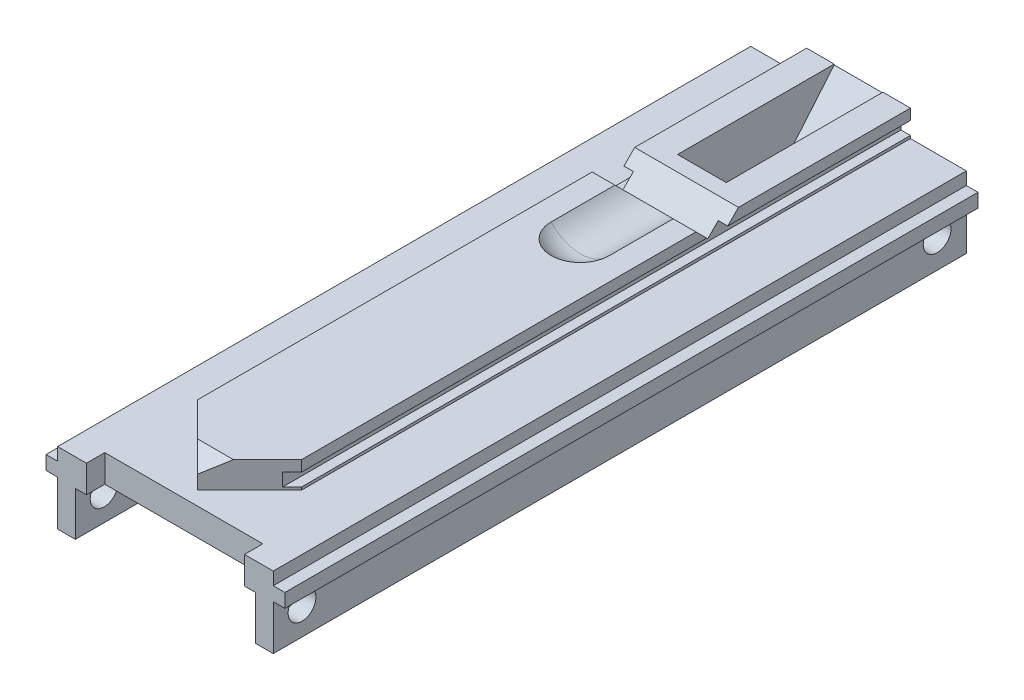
from build123d import *

# Parameters (mm, degrees)
EXTRUDE_1_DEPTH     = 126.5428
SKETCH_2_W          = 28.8544
SKETCH_2_H          = 3.3528
CUT_EXTRUDE_1_DEPTH = 130.646940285
SKETCH_3_R          = 2.54
CUT_EXTRUDE_2_DEPTH = 136.036368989
CUT_EXTRUDE_3_DEPTH = 16.4465
CUT_EXTRUDE_4_DEPTH = 4.445
CUT_EXTRUDE_START   = -4.826
CUT_EXTRUDE_5_DEPTH = 4.826
CUT_EXTRUDE_6_DEPTH = 129.783548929
FILLET_1_R          = 1.5875


with BuildPart() as part:
    # Sketch 1 → Extrude 1 (new body)
    with BuildSketch(Plane.XY):
        Polygon((-9.4742, 17.8816), (9.4742, 17.8816), (9.4742, 15.91564), (7.747, 15.91564), (7.747, 13.55344), (9.4742, 13.55344), (9.4742, 13.0556), (19.685, 13.0556), (19.685, 10.73404), (21.8059, 10.73404), (21.8059, 8.21944), (19.685, 8.21944), (19.685, 0), (-19.685, 0), (-19.685, 8.21944), (-21.8059, 8.21944), (-21.8059, 10.73404), (-19.685, 10.73404), (-19.685, 13.0556), (-9.4742, 13.0556), (-9.4742, 13.55344), (-7.747, 13.55344), (-7.747, 15.91564), (-9.4742, 15.91564), align=None)
    extrude(amount=EXTRUDE_1_DEPTH)

    # Sketch 2 → Cut-Extrude 1 (cut, through all)
    with BuildSketch(Plane(origin=(0, 17.8816, 0), x_dir=(1, 0, 0), z_dir=(0, 1, 0))):
        with Locations((0, -124.8664)):
            Rectangle(SKETCH_2_W, SKETCH_2_H)
    extrude(amount=-CUT_EXTRUDE_1_DEPTH, mode=Mode.SUBTRACT)

    # Sketch 3 → Cut-Extrude 2 (cut, through all)
    with BuildSketch(Plane(origin=(21.8059, 0, 0), x_dir=(0, 0, -1), z_dir=(1, 0, 0))):
        with Locations(Location((-121.29008, 5.0419, 0), (0, 0, 270))):
            Circle(SKETCH_3_R)
        with Locations(Location((-5.33908, 5.334, 0), (0, 0, 270))):
            Circle(SKETCH_3_R)
        Polygon((-126.5428, 13.0556), (-120.65, 13.0556), (-120.65, 15.5956), (-117.385253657, 17.8816), (-126.5428, 17.8816), align=None)
        Polygon((-39.1668, 17.8816), (-31.3944, 17.8816), (-35.2806, 13.9954), align=None)
    extrude(amount=-CUT_EXTRUDE_2_DEPTH, mode=Mode.SUBTRACT)

    # Sketch 4 → Cut-Revolve 1 (revolve, cut)
    with BuildSketch(Plane(origin=(0, 0, 0), x_dir=(0, 0, -1), z_dir=(1, 0, 0))):
        with BuildLine():
            Line((-57.94375, 22.6441), (-35.2806, 22.6441))
            Line((-35.2806, 22.6441), (-35.2806, 15.50035))
            Line((-35.2806, 15.50035), (-50.8, 15.50035))
            ThreePointArc((-50.8, 15.50035), (-55.851394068, 17.592705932), (-57.94375, 22.6441))
        make_face()
    revolve(axis=Axis((0, 22.6441, 61.131106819), (0, 0, -1)), mode=Mode.SUBTRACT)

    # Sketch 5 → Cut-Extrude 3 (cut, symmetric)
    with BuildSketch(Plane(origin=(0, 0, 0), x_dir=(0, 0, -1), z_dir=(1, 0, 0))):
        with BuildLine():
            Line((-6.1722, 0), (-126.5428, 0))
            Line((-126.5428, 0), (-126.5428, 8.0518))
            Line((-126.5428, 8.0518), (-30.663925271, 8.0518))
            ThreePointArc((-30.663925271, 8.0518), (-17.773268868, 5.987214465), (-6.1722, 0))
        make_face()
    extrude(amount=CUT_EXTRUDE_3_DEPTH, both=True, mode=Mode.SUBTRACT)

    # Sketch 6 → Cut-Extrude 4 (cut, symmetric)
    with BuildSketch(Plane(origin=(0, 0, 0), x_dir=(0, 0, -1), z_dir=(1, 0, 0))):
        Polygon((-28.591145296, 17.8816), (-10.709545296, 0), (-3.035364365, 0), (-10.501329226, 5.227724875), (0.116532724, 17.8816), align=None)
    extrude(amount=CUT_EXTRUDE_4_DEPTH, both=True, mode=Mode.SUBTRACT)

    # Sketch 7 → Cut-Extrude 5 (cut)
    with BuildSketch(Plane(origin=(0, 17.8816, 0), x_dir=(1, 0, 0), z_dir=(0, 1, 0)).offset(CUT_EXTRUDE_START)):
        Polygon((9.4742, -123.19), (9.4742, -111.1758), (0, -120.65), (-9.4742, -111.1758), (-9.4742, -123.19), align=None)
    extrude(amount=CUT_EXTRUDE_5_DEPTH, mode=Mode.SUBTRACT)

    # Sketch 8 → Cut-Extrude 6 (cut, through all)
    with BuildSketch(Plane.XZ.offset(-8.0518)):
        with BuildLine():
            Line((6.223, 17.399), (6.223, 30.663925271))
            Line((6.223, 30.663925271), (-6.223, 30.663925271))
            Line((-6.223, 30.663925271), (-6.223, 17.399))
            ThreePointArc((-6.223, 17.399), (0, 11.176), (6.223, 17.399))
        make_face()
    extrude(amount=CUT_EXTRUDE_6_DEPTH, mode=Mode.SUBTRACT)

    # Fillet 1
    fillet_1_edges = [part.edges().sort_by_distance(p)[0] for p in [
        (0, 8.0518, 18.761345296),
    ]]
    fillet(fillet_1_edges, radius=FILLET_1_R)


solid = part.part
